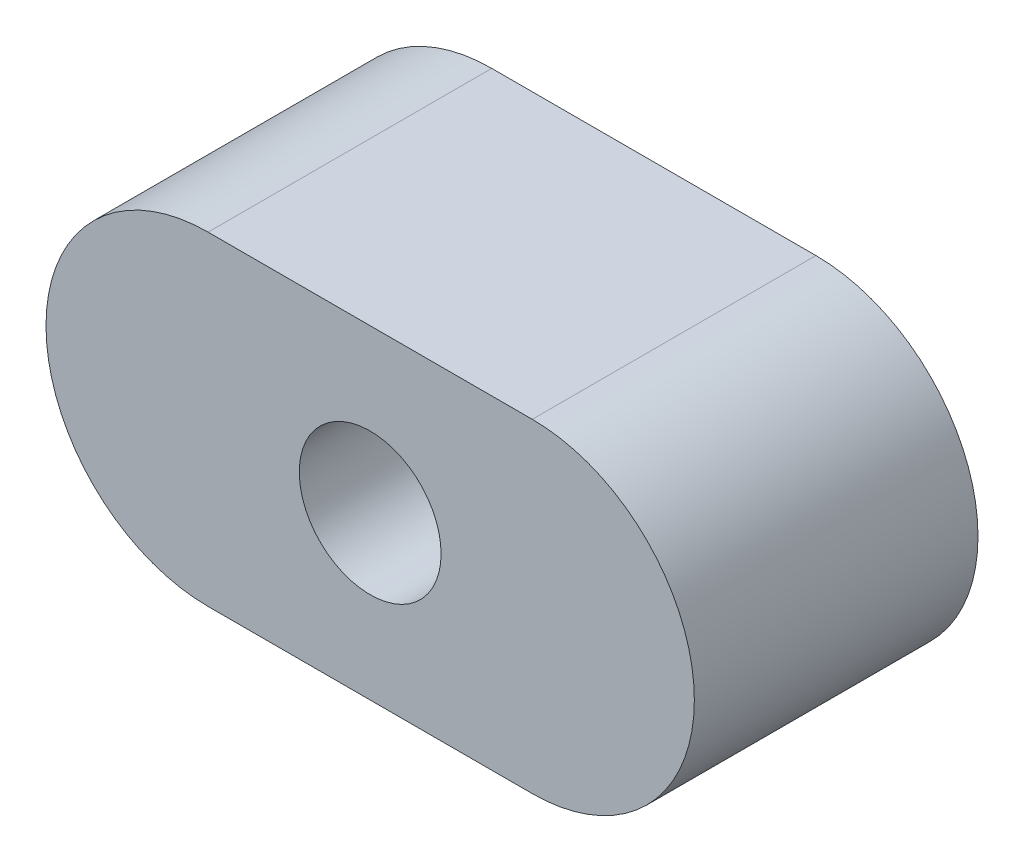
from build123d import *

# Parameters (mm, degrees)
SKETCH_1_R      = 1.75
EXTRUDE_1_DEPTH = 7


with BuildPart() as part:
    # Sketch 1 → Extrude 1 (new body)
    with BuildSketch(Plane.XY):
        with BuildLine():
            Line((-4, 4), (4, 4))
            ThreePointArc((4, 4), (8, 0), (4, -4))
            Line((4, -4), (-4, -4))
            ThreePointArc((-4, -4), (-8, 0), (-4, 4))
        make_face()
        Circle(SKETCH_1_R, mode=Mode.SUBTRACT)
    extrude(amount=EXTRUDE_1_DEPTH)


solid = part.part
